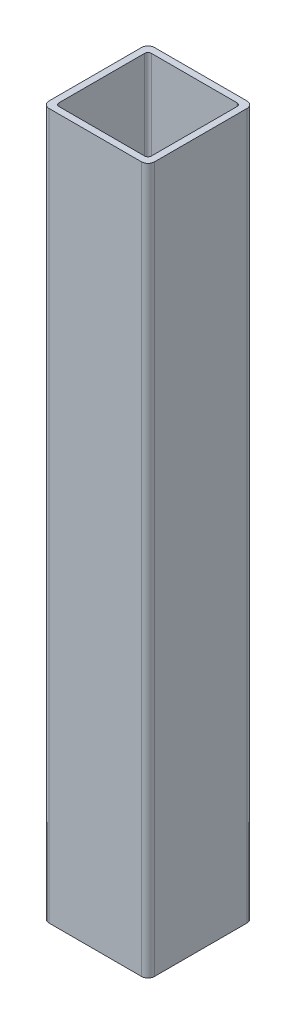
ISO-10303-21;
HEADER;
FILE_DESCRIPTION(('STEP AP214'),'2;1');
FILE_NAME('part.step','',(''),(''),'','','');
FILE_SCHEMA(('AUTOMOTIVE_DESIGN { 1 0 10303 214 1 1 1 1 }'));
ENDSEC;
DATA;
#1=APPLICATION_CONTEXT('core data for automotive mechanical design processes');
#2=APPLICATION_PROTOCOL_DEFINITION('international standard','automotive_design',2000,#1);
#3=PRODUCT_CONTEXT('',#1,'mechanical');
#4=PRODUCT('Part','Part','',(#3));
#5=PRODUCT_RELATED_PRODUCT_CATEGORY('part','',(#4));
#6=PRODUCT_DEFINITION_FORMATION('','',#4);
#7=PRODUCT_DEFINITION_CONTEXT('part definition',#1,'design');
#8=PRODUCT_DEFINITION('design','',#6,#7);
#9=PRODUCT_DEFINITION_SHAPE('','',#8);
#10=(LENGTH_UNIT() NAMED_UNIT(*) SI_UNIT(.MILLI.,.METRE.));
#11=(NAMED_UNIT(*) PLANE_ANGLE_UNIT() SI_UNIT($,.RADIAN.));
#12=(NAMED_UNIT(*) SI_UNIT($,.STERADIAN.) SOLID_ANGLE_UNIT());
#13=UNCERTAINTY_MEASURE_WITH_UNIT(LENGTH_MEASURE(1.E-05),#10,'distance_accuracy_value','');
#14=(GEOMETRIC_REPRESENTATION_CONTEXT(3) GLOBAL_UNCERTAINTY_ASSIGNED_CONTEXT((#13)) GLOBAL_UNIT_ASSIGNED_CONTEXT((#10,
#11,#12)) REPRESENTATION_CONTEXT('',''));
#15=CARTESIAN_POINT('',(0.,0.,0.));
#16=DIRECTION('',(0.,0.,1.));
#17=DIRECTION('',(1.,0.,0.));
#18=AXIS2_PLACEMENT_3D('',#15,#16,#17);
#19=CARTESIAN_POINT('',(22.225,169.8625,22.225));
#20=DIRECTION('',(0.,1.,0.));
#21=DIRECTION('',(0.,0.,1.));
#22=AXIS2_PLACEMENT_3D('',#19,#20,#21);
#23=PLANE('',#22);
#24=CARTESIAN_POINT('',(22.225,169.8625,22.225));
#25=DIRECTION('',(0.,1.,0.));
#26=DIRECTION('',(0.,0.,1.));
#27=AXIS2_PLACEMENT_3D('',#24,#25,#26);
#28=CIRCLE('',#27,3.175);
#29=CARTESIAN_POINT('',(22.225,169.8625,25.4));
#30=VERTEX_POINT('',#29);
#31=CARTESIAN_POINT('',(25.4,169.8625,22.225));
#32=VERTEX_POINT('',#31);
#33=EDGE_CURVE('E211',#30,#32,#28,.T.);
#34=ORIENTED_EDGE('',*,*,#33,.T.);
#35=DIRECTION('',(0.,0.,-1.));
#36=VECTOR('',#35,1.);
#37=CARTESIAN_POINT('',(25.4,169.8625,22.225));
#38=LINE('',#37,#36);
#39=CARTESIAN_POINT('',(25.4,169.8625,-22.225));
#40=VERTEX_POINT('',#39);
#41=EDGE_CURVE('E214',#32,#40,#38,.T.);
#42=ORIENTED_EDGE('',*,*,#41,.T.);
#43=CARTESIAN_POINT('',(22.225,169.8625,-22.225));
#44=DIRECTION('',(0.,1.,0.));
#45=DIRECTION('',(0.,0.,1.));
#46=AXIS2_PLACEMENT_3D('',#43,#44,#45);
#47=CIRCLE('',#46,3.175);
#48=CARTESIAN_POINT('',(22.225,169.8625,-25.4));
#49=VERTEX_POINT('',#48);
#50=EDGE_CURVE('E217',#40,#49,#47,.T.);
#51=ORIENTED_EDGE('',*,*,#50,.T.);
#52=DIRECTION('',(-1.,0.,0.));
#53=VECTOR('',#52,1.);
#54=CARTESIAN_POINT('',(-22.225,169.8625,-25.4));
#55=LINE('',#54,#53);
#56=CARTESIAN_POINT('',(-22.225,169.8625,-25.4));
#57=VERTEX_POINT('',#56);
#58=EDGE_CURVE('E219',#49,#57,#55,.T.);
#59=ORIENTED_EDGE('',*,*,#58,.T.);
#60=CARTESIAN_POINT('',(-22.225,169.8625,-22.225));
#61=DIRECTION('',(0.,1.,0.));
#62=DIRECTION('',(0.,0.,-1.));
#63=AXIS2_PLACEMENT_3D('',#60,#61,#62);
#64=CIRCLE('',#63,3.175);
#65=CARTESIAN_POINT('',(-25.4,169.8625,-22.225));
#66=VERTEX_POINT('',#65);
#67=EDGE_CURVE('E221',#57,#66,#64,.T.);
#68=ORIENTED_EDGE('',*,*,#67,.T.);
#69=DIRECTION('',(0.,0.,1.));
#70=VECTOR('',#69,1.);
#71=CARTESIAN_POINT('',(-25.4,169.8625,22.225));
#72=LINE('',#71,#70);
#73=CARTESIAN_POINT('',(-25.4,169.8625,22.225));
#74=VERTEX_POINT('',#73);
#75=EDGE_CURVE('E223',#66,#74,#72,.T.);
#76=ORIENTED_EDGE('',*,*,#75,.T.);
#77=CARTESIAN_POINT('',(-22.225,169.8625,22.225));
#78=DIRECTION('',(0.,1.,0.));
#79=DIRECTION('',(0.,0.,1.));
#80=AXIS2_PLACEMENT_3D('',#77,#78,#79);
#81=CIRCLE('',#80,3.175);
#82=CARTESIAN_POINT('',(-22.225,169.8625,25.4));
#83=VERTEX_POINT('',#82);
#84=EDGE_CURVE('E225',#74,#83,#81,.T.);
#85=ORIENTED_EDGE('',*,*,#84,.T.);
#86=DIRECTION('',(1.,0.,0.));
#87=VECTOR('',#86,1.);
#88=CARTESIAN_POINT('',(-22.225,169.8625,25.4));
#89=LINE('',#88,#87);
#90=EDGE_CURVE('E227',#83,#30,#89,.T.);
#91=ORIENTED_EDGE('',*,*,#90,.T.);
#92=EDGE_LOOP('',(#34,#42,#51,#59,#68,#76,#85,#91));
#93=FACE_BOUND('',#92,.T.);
#94=DIRECTION('',(1.,0.,0.));
#95=VECTOR('',#94,1.);
#96=CARTESIAN_POINT('',(-20.6375,169.8625,22.225));
#97=LINE('',#96,#95);
#98=CARTESIAN_POINT('',(-20.6375,169.8625,22.225));
#99=VERTEX_POINT('',#98);
#100=CARTESIAN_POINT('',(20.6375,169.8625,22.225));
#101=VERTEX_POINT('',#100);
#102=EDGE_CURVE('E154',#99,#101,#97,.T.);
#103=ORIENTED_EDGE('',*,*,#102,.F.);
#104=CARTESIAN_POINT('',(-20.6375,169.8625,20.6375));
#105=DIRECTION('',(0.,1.,0.));
#106=DIRECTION('',(0.,0.,1.));
#107=AXIS2_PLACEMENT_3D('',#104,#105,#106);
#108=CIRCLE('',#107,1.5875);
#109=CARTESIAN_POINT('',(-22.225,169.8625,20.6375));
#110=VERTEX_POINT('',#109);
#111=EDGE_CURVE('E146',#110,#99,#108,.T.);
#112=ORIENTED_EDGE('',*,*,#111,.F.);
#113=DIRECTION('',(0.,0.,1.));
#114=VECTOR('',#113,1.);
#115=CARTESIAN_POINT('',(-22.225,169.8625,20.6375));
#116=LINE('',#115,#114);
#117=CARTESIAN_POINT('',(-22.225,169.8625,-20.6375));
#118=VERTEX_POINT('',#117);
#119=EDGE_CURVE('E179',#118,#110,#116,.T.);
#120=ORIENTED_EDGE('',*,*,#119,.F.);
#121=CARTESIAN_POINT('',(-20.6375,169.8625,-20.6375));
#122=DIRECTION('',(0.,1.,0.));
#123=DIRECTION('',(0.,0.,-1.));
#124=AXIS2_PLACEMENT_3D('',#121,#122,#123);
#125=CIRCLE('',#124,1.5875);
#126=CARTESIAN_POINT('',(-20.6375,169.8625,-22.225));
#127=VERTEX_POINT('',#126);
#128=EDGE_CURVE('E177',#127,#118,#125,.T.);
#129=ORIENTED_EDGE('',*,*,#128,.F.);
#130=DIRECTION('',(-1.,0.,0.));
#131=VECTOR('',#130,1.);
#132=CARTESIAN_POINT('',(-20.6375,169.8625,-22.225));
#133=LINE('',#132,#131);
#134=CARTESIAN_POINT('',(20.6375,169.8625,-22.225));
#135=VERTEX_POINT('',#134);
#136=EDGE_CURVE('E175',#135,#127,#133,.T.);
#137=ORIENTED_EDGE('',*,*,#136,.F.);
#138=CARTESIAN_POINT('',(20.6375,169.8625,-20.6375));
#139=DIRECTION('',(0.,1.,0.));
#140=DIRECTION('',(0.,0.,1.));
#141=AXIS2_PLACEMENT_3D('',#138,#139,#140);
#142=CIRCLE('',#141,1.5875);
#143=CARTESIAN_POINT('',(22.225,169.8625,-20.6375));
#144=VERTEX_POINT('',#143);
#145=EDGE_CURVE('E173',#144,#135,#142,.T.);
#146=ORIENTED_EDGE('',*,*,#145,.F.);
#147=DIRECTION('',(0.,0.,-1.));
#148=VECTOR('',#147,1.);
#149=CARTESIAN_POINT('',(22.225,169.8625,20.6375));
#150=LINE('',#149,#148);
#151=CARTESIAN_POINT('',(22.225,169.8625,20.6375));
#152=VERTEX_POINT('',#151);
#153=EDGE_CURVE('E169',#152,#144,#150,.T.);
#154=ORIENTED_EDGE('',*,*,#153,.F.);
#155=CARTESIAN_POINT('',(20.6375,169.8625,20.6375));
#156=DIRECTION('',(0.,1.,0.));
#157=DIRECTION('',(0.,0.,1.));
#158=AXIS2_PLACEMENT_3D('',#155,#156,#157);
#159=CIRCLE('',#158,1.5875);
#160=EDGE_CURVE('E167',#101,#152,#159,.T.);
#161=ORIENTED_EDGE('',*,*,#160,.F.);
#162=EDGE_LOOP('',(#103,#112,#120,#129,#137,#146,#154,#161));
#163=FACE_BOUND('',#162,.T.);
#164=ADVANCED_FACE('F33',(#93,#163),#23,.T.);
#165=CARTESIAN_POINT('',(22.225,-169.8625,22.225));
#166=DIRECTION('',(0.,1.,0.));
#167=DIRECTION('',(0.,0.,1.));
#168=AXIS2_PLACEMENT_3D('',#165,#166,#167);
#169=PLANE('',#168);
#170=CARTESIAN_POINT('',(22.225,-169.8625,22.225));
#171=DIRECTION('',(0.,1.,0.));
#172=DIRECTION('',(0.,0.,1.));
#173=AXIS2_PLACEMENT_3D('',#170,#171,#172);
#174=CIRCLE('',#173,3.175);
#175=CARTESIAN_POINT('',(22.225,-169.8625,25.4));
#176=VERTEX_POINT('',#175);
#177=CARTESIAN_POINT('',(25.4,-169.8625,22.225));
#178=VERTEX_POINT('',#177);
#179=EDGE_CURVE('E162',#176,#178,#174,.T.);
#180=ORIENTED_EDGE('',*,*,#179,.F.);
#181=DIRECTION('',(1.,0.,0.));
#182=VECTOR('',#181,1.);
#183=CARTESIAN_POINT('',(-22.225,-169.8625,25.4));
#184=LINE('',#183,#182);
#185=CARTESIAN_POINT('',(-22.225,-169.8625,25.4));
#186=VERTEX_POINT('',#185);
#187=EDGE_CURVE('E215',#186,#176,#184,.T.);
#188=ORIENTED_EDGE('',*,*,#187,.F.);
#189=CARTESIAN_POINT('',(-22.225,-169.8625,22.225));
#190=DIRECTION('',(0.,1.,0.));
#191=DIRECTION('',(0.,0.,1.));
#192=AXIS2_PLACEMENT_3D('',#189,#190,#191);
#193=CIRCLE('',#192,3.175);
#194=CARTESIAN_POINT('',(-25.4,-169.8625,22.225));
#195=VERTEX_POINT('',#194);
#196=EDGE_CURVE('E242',#195,#186,#193,.T.);
#197=ORIENTED_EDGE('',*,*,#196,.F.);
#198=DIRECTION('',(0.,0.,1.));
#199=VECTOR('',#198,1.);
#200=CARTESIAN_POINT('',(-25.4,-169.8625,22.225));
#201=LINE('',#200,#199);
#202=CARTESIAN_POINT('',(-25.4,-169.8625,-22.225));
#203=VERTEX_POINT('',#202);
#204=EDGE_CURVE('E240',#203,#195,#201,.T.);
#205=ORIENTED_EDGE('',*,*,#204,.F.);
#206=CARTESIAN_POINT('',(-22.225,-169.8625,-22.225));
#207=DIRECTION('',(0.,1.,0.));
#208=DIRECTION('',(0.,0.,-1.));
#209=AXIS2_PLACEMENT_3D('',#206,#207,#208);
#210=CIRCLE('',#209,3.175);
#211=CARTESIAN_POINT('',(-22.225,-169.8625,-25.4));
#212=VERTEX_POINT('',#211);
#213=EDGE_CURVE('E238',#212,#203,#210,.T.);
#214=ORIENTED_EDGE('',*,*,#213,.F.);
#215=DIRECTION('',(-1.,0.,0.));
#216=VECTOR('',#215,1.);
#217=CARTESIAN_POINT('',(-22.225,-169.8625,-25.4));
#218=LINE('',#217,#216);
#219=CARTESIAN_POINT('',(22.225,-169.8625,-25.4));
#220=VERTEX_POINT('',#219);
#221=EDGE_CURVE('E236',#220,#212,#218,.T.);
#222=ORIENTED_EDGE('',*,*,#221,.F.);
#223=CARTESIAN_POINT('',(22.225,-169.8625,-22.225));
#224=DIRECTION('',(0.,1.,0.));
#225=DIRECTION('',(0.,0.,1.));
#226=AXIS2_PLACEMENT_3D('',#223,#224,#225);
#227=CIRCLE('',#226,3.175);
#228=CARTESIAN_POINT('',(25.4,-169.8625,-22.225));
#229=VERTEX_POINT('',#228);
#230=EDGE_CURVE('E234',#229,#220,#227,.T.);
#231=ORIENTED_EDGE('',*,*,#230,.F.);
#232=DIRECTION('',(0.,0.,-1.));
#233=VECTOR('',#232,1.);
#234=CARTESIAN_POINT('',(25.4,-169.8625,22.225));
#235=LINE('',#234,#233);
#236=EDGE_CURVE('E232',#178,#229,#235,.T.);
#237=ORIENTED_EDGE('',*,*,#236,.F.);
#238=EDGE_LOOP('',(#180,#188,#197,#205,#214,#222,#231,#237));
#239=FACE_BOUND('',#238,.T.);
#240=CARTESIAN_POINT('',(-20.6375,-169.8625,20.6375));
#241=DIRECTION('',(0.,1.,0.));
#242=DIRECTION('',(0.,0.,1.));
#243=AXIS2_PLACEMENT_3D('',#240,#241,#242);
#244=CIRCLE('',#243,1.5875);
#245=CARTESIAN_POINT('',(-22.225,-169.8625,20.6375));
#246=VERTEX_POINT('',#245);
#247=CARTESIAN_POINT('',(-20.6375,-169.8625,22.225));
#248=VERTEX_POINT('',#247);
#249=EDGE_CURVE('E56',#246,#248,#244,.T.);
#250=ORIENTED_EDGE('',*,*,#249,.T.);
#251=DIRECTION('',(1.,0.,0.));
#252=VECTOR('',#251,1.);
#253=CARTESIAN_POINT('',(-20.6375,-169.8625,22.225));
#254=LINE('',#253,#252);
#255=CARTESIAN_POINT('',(20.6375,-169.8625,22.225));
#256=VERTEX_POINT('',#255);
#257=EDGE_CURVE('E161',#248,#256,#254,.T.);
#258=ORIENTED_EDGE('',*,*,#257,.T.);
#259=CARTESIAN_POINT('',(20.6375,-169.8625,20.6375));
#260=DIRECTION('',(0.,1.,0.));
#261=DIRECTION('',(0.,0.,1.));
#262=AXIS2_PLACEMENT_3D('',#259,#260,#261);
#263=CIRCLE('',#262,1.5875);
#264=CARTESIAN_POINT('',(22.225,-169.8625,20.6375));
#265=VERTEX_POINT('',#264);
#266=EDGE_CURVE('E183',#256,#265,#263,.T.);
#267=ORIENTED_EDGE('',*,*,#266,.T.);
#268=DIRECTION('',(0.,0.,-1.));
#269=VECTOR('',#268,1.);
#270=CARTESIAN_POINT('',(22.225,-169.8625,20.6375));
#271=LINE('',#270,#269);
#272=CARTESIAN_POINT('',(22.225,-169.8625,-20.6375));
#273=VERTEX_POINT('',#272);
#274=EDGE_CURVE('E186',#265,#273,#271,.T.);
#275=ORIENTED_EDGE('',*,*,#274,.T.);
#276=CARTESIAN_POINT('',(20.6375,-169.8625,-20.6375));
#277=DIRECTION('',(0.,1.,0.));
#278=DIRECTION('',(0.,0.,1.));
#279=AXIS2_PLACEMENT_3D('',#276,#277,#278);
#280=CIRCLE('',#279,1.5875);
#281=CARTESIAN_POINT('',(20.6375,-169.8625,-22.225));
#282=VERTEX_POINT('',#281);
#283=EDGE_CURVE('E189',#273,#282,#280,.T.);
#284=ORIENTED_EDGE('',*,*,#283,.T.);
#285=DIRECTION('',(-1.,0.,0.));
#286=VECTOR('',#285,1.);
#287=CARTESIAN_POINT('',(-20.6375,-169.8625,-22.225));
#288=LINE('',#287,#286);
#289=CARTESIAN_POINT('',(-20.6375,-169.8625,-22.225));
#290=VERTEX_POINT('',#289);
#291=EDGE_CURVE('E192',#282,#290,#288,.T.);
#292=ORIENTED_EDGE('',*,*,#291,.T.);
#293=CARTESIAN_POINT('',(-20.6375,-169.8625,-20.6375));
#294=DIRECTION('',(0.,1.,0.));
#295=DIRECTION('',(0.,0.,-1.));
#296=AXIS2_PLACEMENT_3D('',#293,#294,#295);
#297=CIRCLE('',#296,1.5875);
#298=CARTESIAN_POINT('',(-22.225,-169.8625,-20.6375));
#299=VERTEX_POINT('',#298);
#300=EDGE_CURVE('E195',#290,#299,#297,.T.);
#301=ORIENTED_EDGE('',*,*,#300,.T.);
#302=DIRECTION('',(0.,0.,1.));
#303=VECTOR('',#302,1.);
#304=CARTESIAN_POINT('',(-22.225,-169.8625,20.6375));
#305=LINE('',#304,#303);
#306=EDGE_CURVE('E155',#299,#246,#305,.T.);
#307=ORIENTED_EDGE('',*,*,#306,.T.);
#308=EDGE_LOOP('',(#250,#258,#267,#275,#284,#292,#301,#307));
#309=FACE_BOUND('',#308,.T.);
#310=ADVANCED_FACE('F272',(#239,#309),#169,.F.);
#311=CARTESIAN_POINT('',(22.225,169.8625,22.225));
#312=DIRECTION('',(0.,-1.,0.));
#313=DIRECTION('',(0.,0.,-1.));
#314=AXIS2_PLACEMENT_3D('',#311,#312,#313);
#315=CYLINDRICAL_SURFACE('',#314,3.175);
#316=ORIENTED_EDGE('',*,*,#179,.T.);
#317=DIRECTION('',(0.,-1.,0.));
#318=VECTOR('',#317,1.);
#319=CARTESIAN_POINT('',(25.4,169.8625,22.225));
#320=LINE('',#319,#318);
#321=EDGE_CURVE('E11',#32,#178,#320,.T.);
#322=ORIENTED_EDGE('',*,*,#321,.F.);
#323=ORIENTED_EDGE('',*,*,#33,.F.);
#324=DIRECTION('',(0.,-1.,0.));
#325=VECTOR('',#324,1.);
#326=CARTESIAN_POINT('',(22.225,169.8625,25.4));
#327=LINE('',#326,#325);
#328=EDGE_CURVE('E229',#30,#176,#327,.T.);
#329=ORIENTED_EDGE('',*,*,#328,.T.);
#330=EDGE_LOOP('',(#316,#322,#323,#329));
#331=FACE_BOUND('',#330,.T.);
#332=ADVANCED_FACE('F35',(#331),#315,.T.);
#333=CARTESIAN_POINT('',(25.4,169.8625,22.225));
#334=DIRECTION('',(-1.,0.,0.));
#335=DIRECTION('',(0.,0.,1.));
#336=AXIS2_PLACEMENT_3D('',#333,#334,#335);
#337=PLANE('',#336);
#338=ORIENTED_EDGE('',*,*,#236,.T.);
#339=DIRECTION('',(0.,-1.,0.));
#340=VECTOR('',#339,1.);
#341=CARTESIAN_POINT('',(25.4,169.8625,-22.225));
#342=LINE('',#341,#340);
#343=EDGE_CURVE('E41',#40,#229,#342,.T.);
#344=ORIENTED_EDGE('',*,*,#343,.F.);
#345=ORIENTED_EDGE('',*,*,#41,.F.);
#346=ORIENTED_EDGE('',*,*,#321,.T.);
#347=EDGE_LOOP('',(#338,#344,#345,#346));
#348=FACE_BOUND('',#347,.T.);
#349=ADVANCED_FACE('F289',(#348),#337,.F.);
#350=CARTESIAN_POINT('',(22.225,169.8625,-22.225));
#351=DIRECTION('',(0.,-1.,0.));
#352=DIRECTION('',(0.,0.,-1.));
#353=AXIS2_PLACEMENT_3D('',#350,#351,#352);
#354=CYLINDRICAL_SURFACE('',#353,3.175);
#355=ORIENTED_EDGE('',*,*,#230,.T.);
#356=DIRECTION('',(0.,-1.,0.));
#357=VECTOR('',#356,1.);
#358=CARTESIAN_POINT('',(22.225,169.8625,-25.4));
#359=LINE('',#358,#357);
#360=EDGE_CURVE('E259',#49,#220,#359,.T.);
#361=ORIENTED_EDGE('',*,*,#360,.F.);
#362=ORIENTED_EDGE('',*,*,#50,.F.);
#363=ORIENTED_EDGE('',*,*,#343,.T.);
#364=EDGE_LOOP('',(#355,#361,#362,#363));
#365=FACE_BOUND('',#364,.T.);
#366=ADVANCED_FACE('F266',(#365),#354,.T.);
#367=CARTESIAN_POINT('',(-22.225,169.8625,-25.4));
#368=DIRECTION('',(0.,0.,1.));
#369=DIRECTION('',(1.,0.,0.));
#370=AXIS2_PLACEMENT_3D('',#367,#368,#369);
#371=PLANE('',#370);
#372=ORIENTED_EDGE('',*,*,#221,.T.);
#373=DIRECTION('',(0.,-1.,0.));
#374=VECTOR('',#373,1.);
#375=CARTESIAN_POINT('',(-22.225,169.8625,-25.4));
#376=LINE('',#375,#374);
#377=EDGE_CURVE('E256',#57,#212,#376,.T.);
#378=ORIENTED_EDGE('',*,*,#377,.F.);
#379=ORIENTED_EDGE('',*,*,#58,.F.);
#380=ORIENTED_EDGE('',*,*,#360,.T.);
#381=EDGE_LOOP('',(#372,#378,#379,#380));
#382=FACE_BOUND('',#381,.T.);
#383=ADVANCED_FACE('F278',(#382),#371,.F.);
#384=CARTESIAN_POINT('',(-22.225,169.8625,-22.225));
#385=DIRECTION('',(0.,-1.,0.));
#386=DIRECTION('',(0.,0.,-1.));
#387=AXIS2_PLACEMENT_3D('',#384,#385,#386);
#388=CYLINDRICAL_SURFACE('',#387,3.175);
#389=ORIENTED_EDGE('',*,*,#213,.T.);
#390=DIRECTION('',(0.,-1.,0.));
#391=VECTOR('',#390,1.);
#392=CARTESIAN_POINT('',(-25.4,169.8625,-22.225));
#393=LINE('',#392,#391);
#394=EDGE_CURVE('E253',#66,#203,#393,.T.);
#395=ORIENTED_EDGE('',*,*,#394,.F.);
#396=ORIENTED_EDGE('',*,*,#67,.F.);
#397=ORIENTED_EDGE('',*,*,#377,.T.);
#398=EDGE_LOOP('',(#389,#395,#396,#397));
#399=FACE_BOUND('',#398,.T.);
#400=ADVANCED_FACE('F282',(#399),#388,.T.);
#401=CARTESIAN_POINT('',(-25.4,169.8625,22.225));
#402=DIRECTION('',(1.,0.,0.));
#403=DIRECTION('',(0.,0.,-1.));
#404=AXIS2_PLACEMENT_3D('',#401,#402,#403);
#405=PLANE('',#404);
#406=ORIENTED_EDGE('',*,*,#204,.T.);
#407=DIRECTION('',(0.,-1.,0.));
#408=VECTOR('',#407,1.);
#409=CARTESIAN_POINT('',(-25.4,169.8625,22.225));
#410=LINE('',#409,#408);
#411=EDGE_CURVE('E250',#74,#195,#410,.T.);
#412=ORIENTED_EDGE('',*,*,#411,.F.);
#413=ORIENTED_EDGE('',*,*,#75,.F.);
#414=ORIENTED_EDGE('',*,*,#394,.T.);
#415=EDGE_LOOP('',(#406,#412,#413,#414));
#416=FACE_BOUND('',#415,.T.);
#417=ADVANCED_FACE('F302',(#416),#405,.F.);
#418=CARTESIAN_POINT('',(-22.225,169.8625,22.225));
#419=DIRECTION('',(0.,-1.,0.));
#420=DIRECTION('',(0.,0.,-1.));
#421=AXIS2_PLACEMENT_3D('',#418,#419,#420);
#422=CYLINDRICAL_SURFACE('',#421,3.175);
#423=ORIENTED_EDGE('',*,*,#196,.T.);
#424=DIRECTION('',(0.,-1.,0.));
#425=VECTOR('',#424,1.);
#426=CARTESIAN_POINT('',(-22.225,169.8625,25.4));
#427=LINE('',#426,#425);
#428=EDGE_CURVE('E247',#83,#186,#427,.T.);
#429=ORIENTED_EDGE('',*,*,#428,.F.);
#430=ORIENTED_EDGE('',*,*,#84,.F.);
#431=ORIENTED_EDGE('',*,*,#411,.T.);
#432=EDGE_LOOP('',(#423,#429,#430,#431));
#433=FACE_BOUND('',#432,.T.);
#434=ADVANCED_FACE('F300',(#433),#422,.T.);
#435=CARTESIAN_POINT('',(-22.225,169.8625,25.4));
#436=DIRECTION('',(0.,0.,-1.));
#437=DIRECTION('',(-1.,0.,0.));
#438=AXIS2_PLACEMENT_3D('',#435,#436,#437);
#439=PLANE('',#438);
#440=ORIENTED_EDGE('',*,*,#187,.T.);
#441=ORIENTED_EDGE('',*,*,#328,.F.);
#442=ORIENTED_EDGE('',*,*,#90,.F.);
#443=ORIENTED_EDGE('',*,*,#428,.T.);
#444=EDGE_LOOP('',(#440,#441,#442,#443));
#445=FACE_BOUND('',#444,.T.);
#446=ADVANCED_FACE('F295',(#445),#439,.F.);
#447=CARTESIAN_POINT('',(-20.6375,169.8625,20.6375));
#448=DIRECTION('',(0.,-1.,0.));
#449=DIRECTION('',(0.,0.,-1.));
#450=AXIS2_PLACEMENT_3D('',#447,#448,#449);
#451=CYLINDRICAL_SURFACE('',#450,1.5875);
#452=ORIENTED_EDGE('',*,*,#249,.F.);
#453=DIRECTION('',(0.,-1.,0.));
#454=VECTOR('',#453,1.);
#455=CARTESIAN_POINT('',(-22.225,169.8625,20.6375));
#456=LINE('',#455,#454);
#457=EDGE_CURVE('E150',#110,#246,#456,.T.);
#458=ORIENTED_EDGE('',*,*,#457,.F.);
#459=ORIENTED_EDGE('',*,*,#111,.T.);
#460=DIRECTION('',(0.,-1.,0.));
#461=VECTOR('',#460,1.);
#462=CARTESIAN_POINT('',(-20.6375,169.8625,22.225));
#463=LINE('',#462,#461);
#464=EDGE_CURVE('E149',#99,#248,#463,.T.);
#465=ORIENTED_EDGE('',*,*,#464,.T.);
#466=EDGE_LOOP('',(#452,#458,#459,#465));
#467=FACE_BOUND('',#466,.T.);
#468=ADVANCED_FACE('F148',(#467),#451,.F.);
#469=CARTESIAN_POINT('',(-20.6375,169.8625,22.225));
#470=DIRECTION('',(0.,0.,-1.));
#471=DIRECTION('',(-1.,0.,0.));
#472=AXIS2_PLACEMENT_3D('',#469,#470,#471);
#473=PLANE('',#472);
#474=ORIENTED_EDGE('',*,*,#257,.F.);
#475=ORIENTED_EDGE('',*,*,#464,.F.);
#476=ORIENTED_EDGE('',*,*,#102,.T.);
#477=DIRECTION('',(0.,-1.,0.));
#478=VECTOR('',#477,1.);
#479=CARTESIAN_POINT('',(20.6375,169.8625,22.225));
#480=LINE('',#479,#478);
#481=EDGE_CURVE('E163',#101,#256,#480,.T.);
#482=ORIENTED_EDGE('',*,*,#481,.T.);
#483=EDGE_LOOP('',(#474,#475,#476,#482));
#484=FACE_BOUND('',#483,.T.);
#485=ADVANCED_FACE('F158',(#484),#473,.T.);
#486=CARTESIAN_POINT('',(20.6375,169.8625,20.6375));
#487=DIRECTION('',(0.,-1.,0.));
#488=DIRECTION('',(0.,0.,-1.));
#489=AXIS2_PLACEMENT_3D('',#486,#487,#488);
#490=CYLINDRICAL_SURFACE('',#489,1.5875);
#491=ORIENTED_EDGE('',*,*,#266,.F.);
#492=ORIENTED_EDGE('',*,*,#481,.F.);
#493=ORIENTED_EDGE('',*,*,#160,.T.);
#494=DIRECTION('',(0.,-1.,0.));
#495=VECTOR('',#494,1.);
#496=CARTESIAN_POINT('',(22.225,169.8625,20.6375));
#497=LINE('',#496,#495);
#498=EDGE_CURVE('E208',#152,#265,#497,.T.);
#499=ORIENTED_EDGE('',*,*,#498,.T.);
#500=EDGE_LOOP('',(#491,#492,#493,#499));
#501=FACE_BOUND('',#500,.T.);
#502=ADVANCED_FACE('F327',(#501),#490,.F.);
#503=CARTESIAN_POINT('',(22.225,169.8625,20.6375));
#504=DIRECTION('',(-1.,0.,0.));
#505=DIRECTION('',(0.,0.,1.));
#506=AXIS2_PLACEMENT_3D('',#503,#504,#505);
#507=PLANE('',#506);
#508=ORIENTED_EDGE('',*,*,#274,.F.);
#509=ORIENTED_EDGE('',*,*,#498,.F.);
#510=ORIENTED_EDGE('',*,*,#153,.T.);
#511=DIRECTION('',(0.,-1.,0.));
#512=VECTOR('',#511,1.);
#513=CARTESIAN_POINT('',(22.225,169.8625,-20.6375));
#514=LINE('',#513,#512);
#515=EDGE_CURVE('E206',#144,#273,#514,.T.);
#516=ORIENTED_EDGE('',*,*,#515,.T.);
#517=EDGE_LOOP('',(#508,#509,#510,#516));
#518=FACE_BOUND('',#517,.T.);
#519=ADVANCED_FACE('F331',(#518),#507,.T.);
#520=CARTESIAN_POINT('',(20.6375,169.8625,-20.6375));
#521=DIRECTION('',(0.,-1.,0.));
#522=DIRECTION('',(0.,0.,-1.));
#523=AXIS2_PLACEMENT_3D('',#520,#521,#522);
#524=CYLINDRICAL_SURFACE('',#523,1.5875);
#525=ORIENTED_EDGE('',*,*,#283,.F.);
#526=ORIENTED_EDGE('',*,*,#515,.F.);
#527=ORIENTED_EDGE('',*,*,#145,.T.);
#528=DIRECTION('',(0.,-1.,0.));
#529=VECTOR('',#528,1.);
#530=CARTESIAN_POINT('',(20.6375,169.8625,-22.225));
#531=LINE('',#530,#529);
#532=EDGE_CURVE('E204',#135,#282,#531,.T.);
#533=ORIENTED_EDGE('',*,*,#532,.T.);
#534=EDGE_LOOP('',(#525,#526,#527,#533));
#535=FACE_BOUND('',#534,.T.);
#536=ADVANCED_FACE('F337',(#535),#524,.F.);
#537=CARTESIAN_POINT('',(-20.6375,169.8625,-22.225));
#538=DIRECTION('',(0.,0.,1.));
#539=DIRECTION('',(1.,0.,0.));
#540=AXIS2_PLACEMENT_3D('',#537,#538,#539);
#541=PLANE('',#540);
#542=ORIENTED_EDGE('',*,*,#291,.F.);
#543=ORIENTED_EDGE('',*,*,#532,.F.);
#544=ORIENTED_EDGE('',*,*,#136,.T.);
#545=DIRECTION('',(0.,-1.,0.));
#546=VECTOR('',#545,1.);
#547=CARTESIAN_POINT('',(-20.6375,169.8625,-22.225));
#548=LINE('',#547,#546);
#549=EDGE_CURVE('E202',#127,#290,#548,.T.);
#550=ORIENTED_EDGE('',*,*,#549,.T.);
#551=EDGE_LOOP('',(#542,#543,#544,#550));
#552=FACE_BOUND('',#551,.T.);
#553=ADVANCED_FACE('F341',(#552),#541,.T.);
#554=CARTESIAN_POINT('',(-20.6375,169.8625,-20.6375));
#555=DIRECTION('',(0.,-1.,0.));
#556=DIRECTION('',(0.,0.,-1.));
#557=AXIS2_PLACEMENT_3D('',#554,#555,#556);
#558=CYLINDRICAL_SURFACE('',#557,1.5875);
#559=ORIENTED_EDGE('',*,*,#300,.F.);
#560=ORIENTED_EDGE('',*,*,#549,.F.);
#561=ORIENTED_EDGE('',*,*,#128,.T.);
#562=DIRECTION('',(0.,-1.,0.));
#563=VECTOR('',#562,1.);
#564=CARTESIAN_POINT('',(-22.225,169.8625,-20.6375));
#565=LINE('',#564,#563);
#566=EDGE_CURVE('E48',#118,#299,#565,.T.);
#567=ORIENTED_EDGE('',*,*,#566,.T.);
#568=EDGE_LOOP('',(#559,#560,#561,#567));
#569=FACE_BOUND('',#568,.T.);
#570=ADVANCED_FACE('F345',(#569),#558,.F.);
#571=CARTESIAN_POINT('',(-22.225,169.8625,20.6375));
#572=DIRECTION('',(1.,0.,0.));
#573=DIRECTION('',(0.,0.,-1.));
#574=AXIS2_PLACEMENT_3D('',#571,#572,#573);
#575=PLANE('',#574);
#576=ORIENTED_EDGE('',*,*,#306,.F.);
#577=ORIENTED_EDGE('',*,*,#566,.F.);
#578=ORIENTED_EDGE('',*,*,#119,.T.);
#579=ORIENTED_EDGE('',*,*,#457,.T.);
#580=EDGE_LOOP('',(#576,#577,#578,#579));
#581=FACE_BOUND('',#580,.T.);
#582=ADVANCED_FACE('F349',(#581),#575,.T.);
#583=CLOSED_SHELL('',(#164,#310,#332,#349,#366,#383,#400,#417,#434,#446,#468,#485,#502,#519,
#536,#553,#570,#582));
#584=MANIFOLD_SOLID_BREP('B2',#583);
#585=ADVANCED_BREP_SHAPE_REPRESENTATION('',(#18,#584),#14);
#586=SHAPE_DEFINITION_REPRESENTATION(#9,#585);
ENDSEC;
END-ISO-10303-21;
